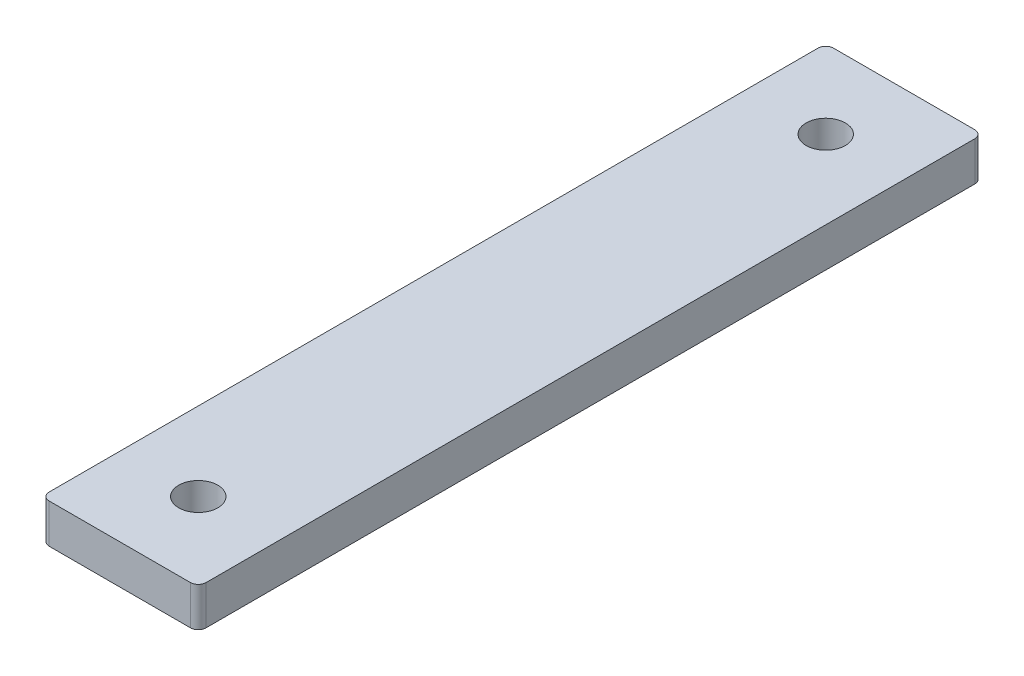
ISO-10303-21;
HEADER;
FILE_DESCRIPTION(('STEP AP214'),'2;1');
FILE_NAME('part.step','',(''),(''),'','','');
FILE_SCHEMA(('AUTOMOTIVE_DESIGN { 1 0 10303 214 1 1 1 1 }'));
ENDSEC;
DATA;
#1=APPLICATION_CONTEXT('core data for automotive mechanical design processes');
#2=APPLICATION_PROTOCOL_DEFINITION('international standard','automotive_design',2000,#1);
#3=PRODUCT_CONTEXT('',#1,'mechanical');
#4=PRODUCT('Part','Part','',(#3));
#5=PRODUCT_RELATED_PRODUCT_CATEGORY('part','',(#4));
#6=PRODUCT_DEFINITION_FORMATION('','',#4);
#7=PRODUCT_DEFINITION_CONTEXT('part definition',#1,'design');
#8=PRODUCT_DEFINITION('design','',#6,#7);
#9=PRODUCT_DEFINITION_SHAPE('','',#8);
#10=(LENGTH_UNIT() NAMED_UNIT(*) SI_UNIT(.MILLI.,.METRE.));
#11=(NAMED_UNIT(*) PLANE_ANGLE_UNIT() SI_UNIT($,.RADIAN.));
#12=(NAMED_UNIT(*) SI_UNIT($,.STERADIAN.) SOLID_ANGLE_UNIT());
#13=UNCERTAINTY_MEASURE_WITH_UNIT(LENGTH_MEASURE(1.E-05),#10,'distance_accuracy_value','');
#14=(GEOMETRIC_REPRESENTATION_CONTEXT(3) GLOBAL_UNCERTAINTY_ASSIGNED_CONTEXT((#13)) GLOBAL_UNIT_ASSIGNED_CONTEXT((#10,
#11,#12)) REPRESENTATION_CONTEXT('',''));
#15=CARTESIAN_POINT('',(0.,0.,0.));
#16=DIRECTION('',(0.,0.,1.));
#17=DIRECTION('',(1.,0.,0.));
#18=AXIS2_PLACEMENT_3D('',#15,#16,#17);
#19=CARTESIAN_POINT('',(0.,5.,0.));
#20=DIRECTION('',(0.,-1.,0.));
#21=DIRECTION('',(0.,0.,-1.));
#22=AXIS2_PLACEMENT_3D('',#19,#20,#21);
#23=PLANE('',#22);
#24=CARTESIAN_POINT('',(10.,5.,-10.));
#25=DIRECTION('',(0.,1.,0.));
#26=DIRECTION('',(0.,0.,1.));
#27=AXIS2_PLACEMENT_3D('',#24,#25,#26);
#28=CIRCLE('',#27,2.5);
#29=CARTESIAN_POINT('',(10.,5.,-7.5));
#30=VERTEX_POINT('',#29);
#31=EDGE_CURVE('E174',#30,#30,#28,.T.);
#32=ORIENTED_EDGE('',*,*,#31,.F.);
#33=EDGE_LOOP('',(#32));
#34=FACE_BOUND('',#33,.T.);
#35=DIRECTION('',(1.,0.,0.));
#36=VECTOR('',#35,1.);
#37=CARTESIAN_POINT('',(0.,5.,0.));
#38=LINE('',#37,#36);
#39=CARTESIAN_POINT('',(1.,5.,0.));
#40=VERTEX_POINT('',#39);
#41=CARTESIAN_POINT('',(19.,5.,0.));
#42=VERTEX_POINT('',#41);
#43=EDGE_CURVE('E168',#40,#42,#38,.T.);
#44=ORIENTED_EDGE('',*,*,#43,.T.);
#45=CARTESIAN_POINT('',(19.,5.,-1.));
#46=DIRECTION('',(0.,-1.,0.));
#47=DIRECTION('',(0.,0.,-1.));
#48=AXIS2_PLACEMENT_3D('',#45,#46,#47);
#49=CIRCLE('',#48,1.);
#50=CARTESIAN_POINT('',(20.,5.,-1.));
#51=VERTEX_POINT('',#50);
#52=EDGE_CURVE('E148',#42,#51,#49,.F.);
#53=ORIENTED_EDGE('',*,*,#52,.T.);
#54=DIRECTION('',(0.,0.,-1.));
#55=VECTOR('',#54,1.);
#56=CARTESIAN_POINT('',(20.,5.,0.));
#57=LINE('',#56,#55);
#58=CARTESIAN_POINT('',(20.,5.,-99.));
#59=VERTEX_POINT('',#58);
#60=EDGE_CURVE('E118',#51,#59,#57,.T.);
#61=ORIENTED_EDGE('',*,*,#60,.T.);
#62=CARTESIAN_POINT('',(19.,5.,-99.));
#63=DIRECTION('',(0.,-1.,0.));
#64=DIRECTION('',(0.,0.,-1.));
#65=AXIS2_PLACEMENT_3D('',#62,#63,#64);
#66=CIRCLE('',#65,1.);
#67=CARTESIAN_POINT('',(19.,5.,-100.));
#68=VERTEX_POINT('',#67);
#69=EDGE_CURVE('E54',#59,#68,#66,.F.);
#70=ORIENTED_EDGE('',*,*,#69,.T.);
#71=DIRECTION('',(-1.,0.,0.));
#72=VECTOR('',#71,1.);
#73=CARTESIAN_POINT('',(0.,5.,-100.));
#74=LINE('',#73,#72);
#75=CARTESIAN_POINT('',(1.,5.,-100.));
#76=VERTEX_POINT('',#75);
#77=EDGE_CURVE('E135',#68,#76,#74,.T.);
#78=ORIENTED_EDGE('',*,*,#77,.T.);
#79=CARTESIAN_POINT('',(1.,5.,-99.));
#80=DIRECTION('',(0.,-1.,0.));
#81=DIRECTION('',(0.,0.,-1.));
#82=AXIS2_PLACEMENT_3D('',#79,#80,#81);
#83=CIRCLE('',#82,1.);
#84=CARTESIAN_POINT('',(0.,5.,-99.));
#85=VERTEX_POINT('',#84);
#86=EDGE_CURVE('E143',#76,#85,#83,.F.);
#87=ORIENTED_EDGE('',*,*,#86,.T.);
#88=DIRECTION('',(0.,0.,1.));
#89=VECTOR('',#88,1.);
#90=CARTESIAN_POINT('',(0.,5.,0.));
#91=LINE('',#90,#89);
#92=CARTESIAN_POINT('',(0.,5.,-1.));
#93=VERTEX_POINT('',#92);
#94=EDGE_CURVE('E129',#85,#93,#91,.T.);
#95=ORIENTED_EDGE('',*,*,#94,.T.);
#96=CARTESIAN_POINT('',(1.,5.,-1.));
#97=DIRECTION('',(0.,-1.,0.));
#98=DIRECTION('',(0.,0.,-1.));
#99=AXIS2_PLACEMENT_3D('',#96,#97,#98);
#100=CIRCLE('',#99,1.);
#101=EDGE_CURVE('E146',#93,#40,#100,.F.);
#102=ORIENTED_EDGE('',*,*,#101,.T.);
#103=EDGE_LOOP('',(#44,#53,#61,#70,#78,#87,#95,#102));
#104=FACE_BOUND('',#103,.T.);
#105=CARTESIAN_POINT('',(10.,5.,-90.));
#106=DIRECTION('',(0.,1.,0.));
#107=DIRECTION('',(0.,0.,1.));
#108=AXIS2_PLACEMENT_3D('',#105,#106,#107);
#109=CIRCLE('',#108,2.5);
#110=CARTESIAN_POINT('',(10.,5.,-87.5));
#111=VERTEX_POINT('',#110);
#112=EDGE_CURVE('E183',#111,#111,#109,.T.);
#113=ORIENTED_EDGE('',*,*,#112,.F.);
#114=EDGE_LOOP('',(#113));
#115=FACE_BOUND('',#114,.T.);
#116=ADVANCED_FACE('F33',(#34,#104,#115),#23,.F.);
#117=CARTESIAN_POINT('',(0.,0.,0.));
#118=DIRECTION('',(0.,-1.,0.));
#119=DIRECTION('',(0.,0.,-1.));
#120=AXIS2_PLACEMENT_3D('',#117,#118,#119);
#121=PLANE('',#120);
#122=CARTESIAN_POINT('',(10.,0.,-10.));
#123=DIRECTION('',(0.,1.,0.));
#124=DIRECTION('',(0.,0.,1.));
#125=AXIS2_PLACEMENT_3D('',#122,#123,#124);
#126=CIRCLE('',#125,2.5);
#127=CARTESIAN_POINT('',(10.,0.,-7.5));
#128=VERTEX_POINT('',#127);
#129=EDGE_CURVE('E176',#128,#128,#126,.T.);
#130=ORIENTED_EDGE('',*,*,#129,.T.);
#131=EDGE_LOOP('',(#130));
#132=FACE_BOUND('',#131,.T.);
#133=DIRECTION('',(0.,0.,-1.));
#134=VECTOR('',#133,1.);
#135=CARTESIAN_POINT('',(20.,0.,0.));
#136=LINE('',#135,#134);
#137=CARTESIAN_POINT('',(20.,0.,-1.));
#138=VERTEX_POINT('',#137);
#139=CARTESIAN_POINT('',(20.,0.,-99.));
#140=VERTEX_POINT('',#139);
#141=EDGE_CURVE('E116',#138,#140,#136,.T.);
#142=ORIENTED_EDGE('',*,*,#141,.F.);
#143=CARTESIAN_POINT('',(19.,0.,-1.));
#144=DIRECTION('',(0.,-1.,0.));
#145=DIRECTION('',(0.,0.,-1.));
#146=AXIS2_PLACEMENT_3D('',#143,#144,#145);
#147=CIRCLE('',#146,1.);
#148=CARTESIAN_POINT('',(19.,0.,0.));
#149=VERTEX_POINT('',#148);
#150=EDGE_CURVE('E99',#138,#149,#147,.T.);
#151=ORIENTED_EDGE('',*,*,#150,.T.);
#152=DIRECTION('',(1.,0.,0.));
#153=VECTOR('',#152,1.);
#154=CARTESIAN_POINT('',(0.,0.,0.));
#155=LINE('',#154,#153);
#156=CARTESIAN_POINT('',(1.,0.,0.));
#157=VERTEX_POINT('',#156);
#158=EDGE_CURVE('E127',#157,#149,#155,.T.);
#159=ORIENTED_EDGE('',*,*,#158,.F.);
#160=CARTESIAN_POINT('',(1.,0.,-1.));
#161=DIRECTION('',(0.,-1.,0.));
#162=DIRECTION('',(0.,0.,-1.));
#163=AXIS2_PLACEMENT_3D('',#160,#161,#162);
#164=CIRCLE('',#163,1.);
#165=CARTESIAN_POINT('',(0.,0.,-1.));
#166=VERTEX_POINT('',#165);
#167=EDGE_CURVE('E110',#157,#166,#164,.T.);
#168=ORIENTED_EDGE('',*,*,#167,.T.);
#169=DIRECTION('',(0.,0.,1.));
#170=VECTOR('',#169,1.);
#171=CARTESIAN_POINT('',(0.,0.,0.));
#172=LINE('',#171,#170);
#173=CARTESIAN_POINT('',(0.,0.,-99.));
#174=VERTEX_POINT('',#173);
#175=EDGE_CURVE('E131',#174,#166,#172,.T.);
#176=ORIENTED_EDGE('',*,*,#175,.F.);
#177=CARTESIAN_POINT('',(1.,0.,-99.));
#178=DIRECTION('',(0.,-1.,0.));
#179=DIRECTION('',(0.,0.,-1.));
#180=AXIS2_PLACEMENT_3D('',#177,#178,#179);
#181=CIRCLE('',#180,1.);
#182=CARTESIAN_POINT('',(1.,0.,-100.));
#183=VERTEX_POINT('',#182);
#184=EDGE_CURVE('E119',#174,#183,#181,.T.);
#185=ORIENTED_EDGE('',*,*,#184,.T.);
#186=DIRECTION('',(-1.,0.,0.));
#187=VECTOR('',#186,1.);
#188=CARTESIAN_POINT('',(0.,0.,-100.));
#189=LINE('',#188,#187);
#190=CARTESIAN_POINT('',(19.,0.,-100.));
#191=VERTEX_POINT('',#190);
#192=EDGE_CURVE('E126',#191,#183,#189,.T.);
#193=ORIENTED_EDGE('',*,*,#192,.F.);
#194=CARTESIAN_POINT('',(19.,0.,-99.));
#195=DIRECTION('',(0.,-1.,0.));
#196=DIRECTION('',(0.,0.,-1.));
#197=AXIS2_PLACEMENT_3D('',#194,#195,#196);
#198=CIRCLE('',#197,1.);
#199=EDGE_CURVE('E125',#191,#140,#198,.T.);
#200=ORIENTED_EDGE('',*,*,#199,.T.);
#201=EDGE_LOOP('',(#142,#151,#159,#168,#176,#185,#193,#200));
#202=FACE_BOUND('',#201,.T.);
#203=CARTESIAN_POINT('',(10.,0.,-90.));
#204=DIRECTION('',(0.,1.,0.));
#205=DIRECTION('',(0.,0.,1.));
#206=AXIS2_PLACEMENT_3D('',#203,#204,#205);
#207=CIRCLE('',#206,2.5);
#208=CARTESIAN_POINT('',(10.,0.,-87.5));
#209=VERTEX_POINT('',#208);
#210=EDGE_CURVE('E185',#209,#209,#207,.T.);
#211=ORIENTED_EDGE('',*,*,#210,.T.);
#212=EDGE_LOOP('',(#211));
#213=FACE_BOUND('',#212,.T.);
#214=ADVANCED_FACE('F122',(#132,#202,#213),#121,.T.);
#215=CARTESIAN_POINT('',(0.,5.,0.));
#216=DIRECTION('',(1.,0.,0.));
#217=DIRECTION('',(0.,0.,-1.));
#218=AXIS2_PLACEMENT_3D('',#215,#216,#217);
#219=PLANE('',#218);
#220=ORIENTED_EDGE('',*,*,#175,.T.);
#221=DIRECTION('',(0.,-1.,0.));
#222=VECTOR('',#221,1.);
#223=CARTESIAN_POINT('',(0.,5.,-1.));
#224=LINE('',#223,#222);
#225=EDGE_CURVE('E153',#166,#93,#224,.F.);
#226=ORIENTED_EDGE('',*,*,#225,.T.);
#227=ORIENTED_EDGE('',*,*,#94,.F.);
#228=DIRECTION('',(0.,-1.,0.));
#229=VECTOR('',#228,1.);
#230=CARTESIAN_POINT('',(0.,5.,-99.));
#231=LINE('',#230,#229);
#232=EDGE_CURVE('E150',#85,#174,#231,.T.);
#233=ORIENTED_EDGE('',*,*,#232,.T.);
#234=EDGE_LOOP('',(#220,#226,#227,#233));
#235=FACE_BOUND('',#234,.T.);
#236=ADVANCED_FACE('F159',(#235),#219,.F.);
#237=CARTESIAN_POINT('',(0.,5.,0.));
#238=DIRECTION('',(0.,0.,-1.));
#239=DIRECTION('',(-1.,0.,0.));
#240=AXIS2_PLACEMENT_3D('',#237,#238,#239);
#241=PLANE('',#240);
#242=ORIENTED_EDGE('',*,*,#158,.T.);
#243=DIRECTION('',(0.,-1.,0.));
#244=VECTOR('',#243,1.);
#245=CARTESIAN_POINT('',(19.,5.,0.));
#246=LINE('',#245,#244);
#247=EDGE_CURVE('E104',#149,#42,#246,.F.);
#248=ORIENTED_EDGE('',*,*,#247,.T.);
#249=ORIENTED_EDGE('',*,*,#43,.F.);
#250=DIRECTION('',(0.,-1.,0.));
#251=VECTOR('',#250,1.);
#252=CARTESIAN_POINT('',(1.,5.,0.));
#253=LINE('',#252,#251);
#254=EDGE_CURVE('E109',#40,#157,#253,.T.);
#255=ORIENTED_EDGE('',*,*,#254,.T.);
#256=EDGE_LOOP('',(#242,#248,#249,#255));
#257=FACE_BOUND('',#256,.T.);
#258=ADVANCED_FACE('F173',(#257),#241,.F.);
#259=CARTESIAN_POINT('',(20.,5.,0.));
#260=DIRECTION('',(-1.,0.,0.));
#261=DIRECTION('',(0.,0.,1.));
#262=AXIS2_PLACEMENT_3D('',#259,#260,#261);
#263=PLANE('',#262);
#264=ORIENTED_EDGE('',*,*,#60,.F.);
#265=DIRECTION('',(0.,-1.,0.));
#266=VECTOR('',#265,1.);
#267=CARTESIAN_POINT('',(20.,5.,-1.));
#268=LINE('',#267,#266);
#269=EDGE_CURVE('E103',#51,#138,#268,.T.);
#270=ORIENTED_EDGE('',*,*,#269,.T.);
#271=ORIENTED_EDGE('',*,*,#141,.T.);
#272=DIRECTION('',(0.,-1.,0.));
#273=VECTOR('',#272,1.);
#274=CARTESIAN_POINT('',(20.,5.,-99.));
#275=LINE('',#274,#273);
#276=EDGE_CURVE('E120',#140,#59,#275,.F.);
#277=ORIENTED_EDGE('',*,*,#276,.T.);
#278=EDGE_LOOP('',(#264,#270,#271,#277));
#279=FACE_BOUND('',#278,.T.);
#280=ADVANCED_FACE('F115',(#279),#263,.F.);
#281=CARTESIAN_POINT('',(0.,5.,-100.));
#282=DIRECTION('',(0.,0.,1.));
#283=DIRECTION('',(1.,0.,0.));
#284=AXIS2_PLACEMENT_3D('',#281,#282,#283);
#285=PLANE('',#284);
#286=ORIENTED_EDGE('',*,*,#77,.F.);
#287=DIRECTION('',(0.,-1.,0.));
#288=VECTOR('',#287,1.);
#289=CARTESIAN_POINT('',(19.,5.,-100.));
#290=LINE('',#289,#288);
#291=EDGE_CURVE('E11',#68,#191,#290,.T.);
#292=ORIENTED_EDGE('',*,*,#291,.T.);
#293=ORIENTED_EDGE('',*,*,#192,.T.);
#294=DIRECTION('',(0.,-1.,0.));
#295=VECTOR('',#294,1.);
#296=CARTESIAN_POINT('',(1.,5.,-100.));
#297=LINE('',#296,#295);
#298=EDGE_CURVE('E41',#183,#76,#297,.F.);
#299=ORIENTED_EDGE('',*,*,#298,.T.);
#300=EDGE_LOOP('',(#286,#292,#293,#299));
#301=FACE_BOUND('',#300,.T.);
#302=ADVANCED_FACE('F206',(#301),#285,.F.);
#303=CARTESIAN_POINT('',(10.,5.,-10.));
#304=DIRECTION('',(0.,-1.,0.));
#305=DIRECTION('',(0.,0.,-1.));
#306=AXIS2_PLACEMENT_3D('',#303,#304,#305);
#307=CYLINDRICAL_SURFACE('',#306,2.5);
#308=ORIENTED_EDGE('',*,*,#31,.T.);
#309=EDGE_LOOP('',(#308));
#310=FACE_BOUND('',#309,.T.);
#311=ORIENTED_EDGE('',*,*,#129,.F.);
#312=EDGE_LOOP('',(#311));
#313=FACE_BOUND('',#312,.T.);
#314=ADVANCED_FACE('F203',(#310,#313),#307,.F.);
#315=CARTESIAN_POINT('',(10.,5.,-90.));
#316=DIRECTION('',(0.,-1.,0.));
#317=DIRECTION('',(0.,0.,-1.));
#318=AXIS2_PLACEMENT_3D('',#315,#316,#317);
#319=CYLINDRICAL_SURFACE('',#318,2.5);
#320=ORIENTED_EDGE('',*,*,#112,.T.);
#321=EDGE_LOOP('',(#320));
#322=FACE_BOUND('',#321,.T.);
#323=ORIENTED_EDGE('',*,*,#210,.F.);
#324=EDGE_LOOP('',(#323));
#325=FACE_BOUND('',#324,.T.);
#326=ADVANCED_FACE('F191',(#322,#325),#319,.F.);
#327=CARTESIAN_POINT('',(19.,5.,-1.));
#328=DIRECTION('',(0.,-1.,0.));
#329=DIRECTION('',(0.,0.,-1.));
#330=AXIS2_PLACEMENT_3D('',#327,#328,#329);
#331=CYLINDRICAL_SURFACE('',#330,1.);
#332=ORIENTED_EDGE('',*,*,#52,.F.);
#333=ORIENTED_EDGE('',*,*,#247,.F.);
#334=ORIENTED_EDGE('',*,*,#150,.F.);
#335=ORIENTED_EDGE('',*,*,#269,.F.);
#336=EDGE_LOOP('',(#332,#333,#334,#335));
#337=FACE_BOUND('',#336,.T.);
#338=ADVANCED_FACE('F102',(#337),#331,.T.);
#339=CARTESIAN_POINT('',(1.,5.,-1.));
#340=DIRECTION('',(0.,-1.,0.));
#341=DIRECTION('',(0.,0.,-1.));
#342=AXIS2_PLACEMENT_3D('',#339,#340,#341);
#343=CYLINDRICAL_SURFACE('',#342,1.);
#344=ORIENTED_EDGE('',*,*,#101,.F.);
#345=ORIENTED_EDGE('',*,*,#225,.F.);
#346=ORIENTED_EDGE('',*,*,#167,.F.);
#347=ORIENTED_EDGE('',*,*,#254,.F.);
#348=EDGE_LOOP('',(#344,#345,#346,#347));
#349=FACE_BOUND('',#348,.T.);
#350=ADVANCED_FACE('F171',(#349),#343,.T.);
#351=CARTESIAN_POINT('',(19.,5.,-99.));
#352=DIRECTION('',(0.,-1.,0.));
#353=DIRECTION('',(0.,0.,-1.));
#354=AXIS2_PLACEMENT_3D('',#351,#352,#353);
#355=CYLINDRICAL_SURFACE('',#354,1.);
#356=ORIENTED_EDGE('',*,*,#69,.F.);
#357=ORIENTED_EDGE('',*,*,#276,.F.);
#358=ORIENTED_EDGE('',*,*,#199,.F.);
#359=ORIENTED_EDGE('',*,*,#291,.F.);
#360=EDGE_LOOP('',(#356,#357,#358,#359));
#361=FACE_BOUND('',#360,.T.);
#362=ADVANCED_FACE('F218',(#361),#355,.T.);
#363=CARTESIAN_POINT('',(1.,5.,-99.));
#364=DIRECTION('',(0.,-1.,0.));
#365=DIRECTION('',(0.,0.,-1.));
#366=AXIS2_PLACEMENT_3D('',#363,#364,#365);
#367=CYLINDRICAL_SURFACE('',#366,1.);
#368=ORIENTED_EDGE('',*,*,#86,.F.);
#369=ORIENTED_EDGE('',*,*,#298,.F.);
#370=ORIENTED_EDGE('',*,*,#184,.F.);
#371=ORIENTED_EDGE('',*,*,#232,.F.);
#372=EDGE_LOOP('',(#368,#369,#370,#371));
#373=FACE_BOUND('',#372,.T.);
#374=ADVANCED_FACE('F35',(#373),#367,.T.);
#375=CLOSED_SHELL('',(#116,#214,#236,#258,#280,#302,#314,#326,#338,#350,#362,#374));
#376=MANIFOLD_SOLID_BREP('B2',#375);
#377=ADVANCED_BREP_SHAPE_REPRESENTATION('',(#18,#376),#14);
#378=SHAPE_DEFINITION_REPRESENTATION(#9,#377);
ENDSEC;
END-ISO-10303-21;
